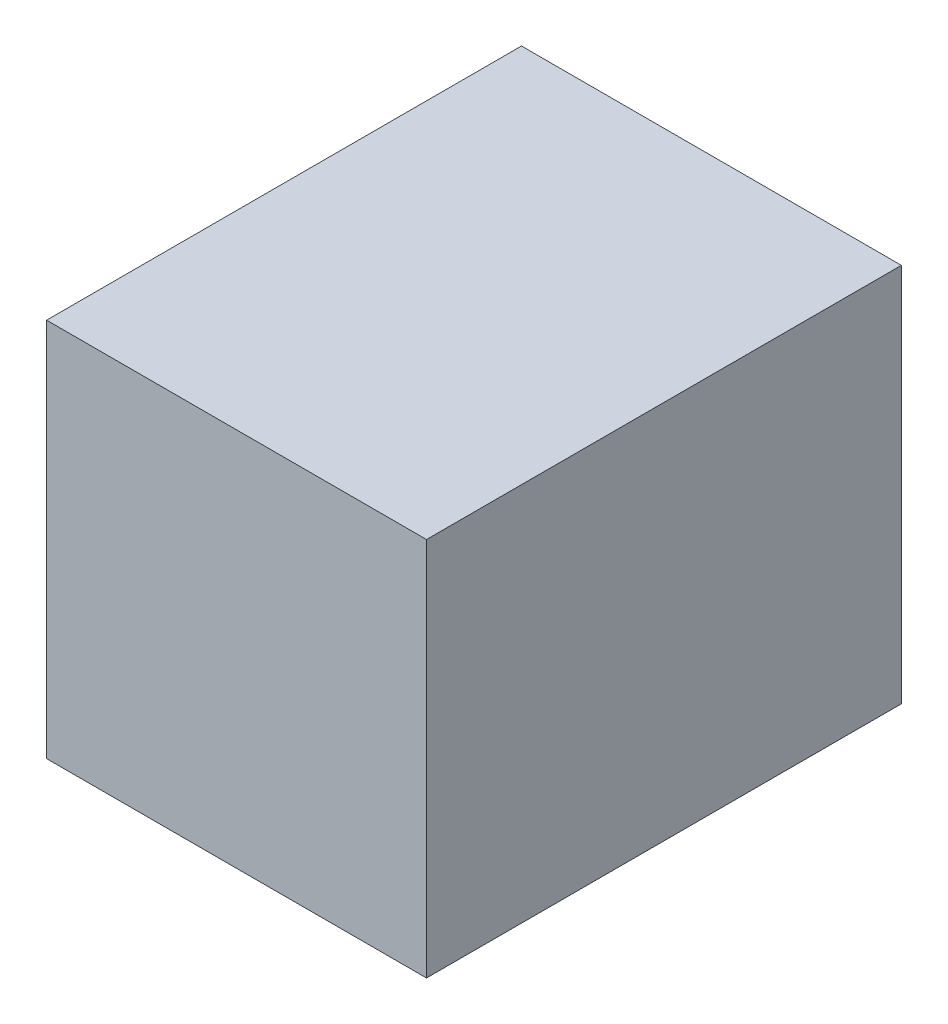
ISO-10303-21;
HEADER;
FILE_DESCRIPTION(('STEP AP214'),'2;1');
FILE_NAME('part.step','',(''),(''),'','','');
FILE_SCHEMA(('AUTOMOTIVE_DESIGN { 1 0 10303 214 1 1 1 1 }'));
ENDSEC;
DATA;
#1=APPLICATION_CONTEXT('core data for automotive mechanical design processes');
#2=APPLICATION_PROTOCOL_DEFINITION('international standard','automotive_design',2000,#1);
#3=PRODUCT_CONTEXT('',#1,'mechanical');
#4=PRODUCT('Part','Part','',(#3));
#5=PRODUCT_RELATED_PRODUCT_CATEGORY('part','',(#4));
#6=PRODUCT_DEFINITION_FORMATION('','',#4);
#7=PRODUCT_DEFINITION_CONTEXT('part definition',#1,'design');
#8=PRODUCT_DEFINITION('design','',#6,#7);
#9=PRODUCT_DEFINITION_SHAPE('','',#8);
#10=(LENGTH_UNIT() NAMED_UNIT(*) SI_UNIT(.MILLI.,.METRE.));
#11=(NAMED_UNIT(*) PLANE_ANGLE_UNIT() SI_UNIT($,.RADIAN.));
#12=(NAMED_UNIT(*) SI_UNIT($,.STERADIAN.) SOLID_ANGLE_UNIT());
#13=UNCERTAINTY_MEASURE_WITH_UNIT(LENGTH_MEASURE(1.E-05),#10,'distance_accuracy_value','');
#14=(GEOMETRIC_REPRESENTATION_CONTEXT(3) GLOBAL_UNCERTAINTY_ASSIGNED_CONTEXT((#13)) GLOBAL_UNIT_ASSIGNED_CONTEXT((#10,
#11,#12)) REPRESENTATION_CONTEXT('',''));
#15=CARTESIAN_POINT('',(0.,0.,0.));
#16=DIRECTION('',(0.,0.,1.));
#17=DIRECTION('',(1.,0.,0.));
#18=AXIS2_PLACEMENT_3D('',#15,#16,#17);
#19=CARTESIAN_POINT('',(0.,0.,0.2499995));
#20=DIRECTION('',(0.,0.,1.));
#21=DIRECTION('',(1.,0.,0.));
#22=AXIS2_PLACEMENT_3D('',#19,#20,#21);
#23=PLANE('',#22);
#24=DIRECTION('',(1.,0.,0.));
#25=VECTOR('',#24,1.);
#26=CARTESIAN_POINT('',(-0.09999980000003,-0.09995916,0.2499995));
#27=LINE('',#26,#25);
#28=CARTESIAN_POINT('',(-0.09999980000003,-0.09995916,0.2499995));
#29=VERTEX_POINT('',#28);
#30=CARTESIAN_POINT('',(0.09999980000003,-0.09995916,0.2499995));
#31=VERTEX_POINT('',#30);
#32=EDGE_CURVE('E84',#29,#31,#27,.T.);
#33=ORIENTED_EDGE('',*,*,#32,.T.);
#34=DIRECTION('',(0.,1.,0.));
#35=VECTOR('',#34,1.);
#36=CARTESIAN_POINT('',(0.09999980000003,-0.09995916,0.2499995));
#37=LINE('',#36,#35);
#38=CARTESIAN_POINT('',(0.09999980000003,0.09995916,0.2499995));
#39=VERTEX_POINT('',#38);
#40=EDGE_CURVE('E103',#31,#39,#37,.T.);
#41=ORIENTED_EDGE('',*,*,#40,.T.);
#42=DIRECTION('',(-1.,0.,0.));
#43=VECTOR('',#42,1.);
#44=CARTESIAN_POINT('',(0.09999980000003,0.09995916,0.2499995));
#45=LINE('',#44,#43);
#46=CARTESIAN_POINT('',(-0.09999980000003,0.09995916,0.2499995));
#47=VERTEX_POINT('',#46);
#48=EDGE_CURVE('E21',#39,#47,#45,.T.);
#49=ORIENTED_EDGE('',*,*,#48,.T.);
#50=DIRECTION('',(0.,-1.,0.));
#51=VECTOR('',#50,1.);
#52=CARTESIAN_POINT('',(-0.09999980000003,0.09995916,0.2499995));
#53=LINE('',#52,#51);
#54=EDGE_CURVE('E11',#47,#29,#53,.T.);
#55=ORIENTED_EDGE('',*,*,#54,.T.);
#56=EDGE_LOOP('',(#33,#41,#49,#55));
#57=FACE_BOUND('',#56,.T.);
#58=ADVANCED_FACE('F17',(#57),#23,.T.);
#59=CARTESIAN_POINT('',(0.,0.,0.));
#60=DIRECTION('',(0.,0.,1.));
#61=DIRECTION('',(1.,0.,0.));
#62=AXIS2_PLACEMENT_3D('',#59,#60,#61);
#63=PLANE('',#62);
#64=DIRECTION('',(0.,-1.,0.));
#65=VECTOR('',#64,1.);
#66=CARTESIAN_POINT('',(-0.09999980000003,0.09995916,0.));
#67=LINE('',#66,#65);
#68=CARTESIAN_POINT('',(-0.09999980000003,0.09995916,0.));
#69=VERTEX_POINT('',#68);
#70=CARTESIAN_POINT('',(-0.09999980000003,-0.09995916,0.));
#71=VERTEX_POINT('',#70);
#72=EDGE_CURVE('E27',#69,#71,#67,.T.);
#73=ORIENTED_EDGE('',*,*,#72,.F.);
#74=DIRECTION('',(-1.,0.,0.));
#75=VECTOR('',#74,1.);
#76=CARTESIAN_POINT('',(0.09999980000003,0.09995916,0.));
#77=LINE('',#76,#75);
#78=CARTESIAN_POINT('',(0.09999980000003,0.09995916,0.));
#79=VERTEX_POINT('',#78);
#80=EDGE_CURVE('E111',#79,#69,#77,.T.);
#81=ORIENTED_EDGE('',*,*,#80,.F.);
#82=DIRECTION('',(0.,1.,0.));
#83=VECTOR('',#82,1.);
#84=CARTESIAN_POINT('',(0.09999980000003,-0.09995916,0.));
#85=LINE('',#84,#83);
#86=CARTESIAN_POINT('',(0.09999980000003,-0.09995916,0.));
#87=VERTEX_POINT('',#86);
#88=EDGE_CURVE('E86',#87,#79,#85,.T.);
#89=ORIENTED_EDGE('',*,*,#88,.F.);
#90=DIRECTION('',(1.,0.,0.));
#91=VECTOR('',#90,1.);
#92=CARTESIAN_POINT('',(-0.09999980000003,-0.09995916,0.));
#93=LINE('',#92,#91);
#94=EDGE_CURVE('E82',#71,#87,#93,.T.);
#95=ORIENTED_EDGE('',*,*,#94,.F.);
#96=EDGE_LOOP('',(#73,#81,#89,#95));
#97=FACE_BOUND('',#96,.T.);
#98=ADVANCED_FACE('F19',(#97),#63,.F.);
#99=CARTESIAN_POINT('',(-0.09999980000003,0.09995916,0.));
#100=DIRECTION('',(1.,0.,0.));
#101=DIRECTION('',(0.,1.,0.));
#102=AXIS2_PLACEMENT_3D('',#99,#100,#101);
#103=PLANE('',#102);
#104=ORIENTED_EDGE('',*,*,#72,.T.);
#105=DIRECTION('',(0.,0.,1.));
#106=VECTOR('',#105,1.);
#107=CARTESIAN_POINT('',(-0.09999980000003,-0.09995916,0.));
#108=LINE('',#107,#106);
#109=EDGE_CURVE('E71',#71,#29,#108,.T.);
#110=ORIENTED_EDGE('',*,*,#109,.T.);
#111=ORIENTED_EDGE('',*,*,#54,.F.);
#112=DIRECTION('',(0.,0.,1.));
#113=VECTOR('',#112,1.);
#114=CARTESIAN_POINT('',(-0.09999980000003,0.09995916,0.));
#115=LINE('',#114,#113);
#116=EDGE_CURVE('E74',#69,#47,#115,.T.);
#117=ORIENTED_EDGE('',*,*,#116,.F.);
#118=EDGE_LOOP('',(#104,#110,#111,#117));
#119=FACE_BOUND('',#118,.T.);
#120=ADVANCED_FACE('F70',(#119),#103,.F.);
#121=CARTESIAN_POINT('',(0.09999980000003,0.09995916,0.));
#122=DIRECTION('',(0.,-1.,0.));
#123=DIRECTION('',(0.,0.,-1.));
#124=AXIS2_PLACEMENT_3D('',#121,#122,#123);
#125=PLANE('',#124);
#126=ORIENTED_EDGE('',*,*,#80,.T.);
#127=ORIENTED_EDGE('',*,*,#116,.T.);
#128=ORIENTED_EDGE('',*,*,#48,.F.);
#129=DIRECTION('',(0.,0.,1.));
#130=VECTOR('',#129,1.);
#131=CARTESIAN_POINT('',(0.09999980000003,0.09995916,0.));
#132=LINE('',#131,#130);
#133=EDGE_CURVE('E99',#79,#39,#132,.T.);
#134=ORIENTED_EDGE('',*,*,#133,.F.);
#135=EDGE_LOOP('',(#126,#127,#128,#134));
#136=FACE_BOUND('',#135,.T.);
#137=ADVANCED_FACE('F122',(#136),#125,.F.);
#138=CARTESIAN_POINT('',(0.09999980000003,-0.09995916,0.));
#139=DIRECTION('',(-1.,0.,0.));
#140=DIRECTION('',(0.,0.,1.));
#141=AXIS2_PLACEMENT_3D('',#138,#139,#140);
#142=PLANE('',#141);
#143=ORIENTED_EDGE('',*,*,#88,.T.);
#144=ORIENTED_EDGE('',*,*,#133,.T.);
#145=ORIENTED_EDGE('',*,*,#40,.F.);
#146=DIRECTION('',(0.,0.,1.));
#147=VECTOR('',#146,1.);
#148=CARTESIAN_POINT('',(0.09999980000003,-0.09995916,0.));
#149=LINE('',#148,#147);
#150=EDGE_CURVE('E91',#87,#31,#149,.T.);
#151=ORIENTED_EDGE('',*,*,#150,.F.);
#152=EDGE_LOOP('',(#143,#144,#145,#151));
#153=FACE_BOUND('',#152,.T.);
#154=ADVANCED_FACE('F124',(#153),#142,.F.);
#155=CARTESIAN_POINT('',(-0.09999980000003,-0.09995916,0.));
#156=DIRECTION('',(0.,1.,0.));
#157=DIRECTION('',(1.,0.,0.));
#158=AXIS2_PLACEMENT_3D('',#155,#156,#157);
#159=PLANE('',#158);
#160=ORIENTED_EDGE('',*,*,#94,.T.);
#161=ORIENTED_EDGE('',*,*,#150,.T.);
#162=ORIENTED_EDGE('',*,*,#32,.F.);
#163=ORIENTED_EDGE('',*,*,#109,.F.);
#164=EDGE_LOOP('',(#160,#161,#162,#163));
#165=FACE_BOUND('',#164,.T.);
#166=ADVANCED_FACE('F80',(#165),#159,.F.);
#167=CLOSED_SHELL('',(#58,#98,#120,#137,#154,#166));
#168=MANIFOLD_SOLID_BREP('B1',#167);
#169=ADVANCED_BREP_SHAPE_REPRESENTATION('',(#18,#168),#14);
#170=SHAPE_DEFINITION_REPRESENTATION(#9,#169);
ENDSEC;
END-ISO-10303-21;
